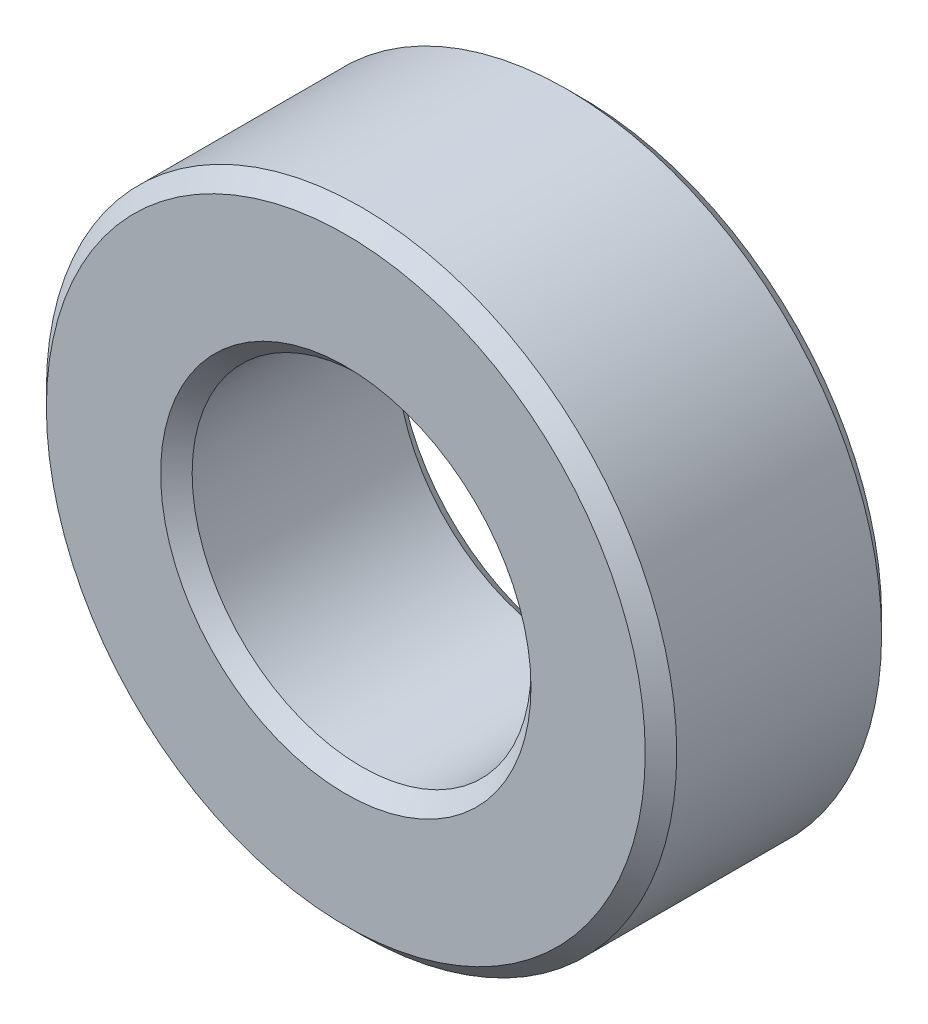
ISO-10303-21;
HEADER;
FILE_DESCRIPTION(('STEP AP214'),'2;1');
FILE_NAME('part.step','',(''),(''),'','','');
FILE_SCHEMA(('AUTOMOTIVE_DESIGN { 1 0 10303 214 1 1 1 1 }'));
ENDSEC;
DATA;
#1=APPLICATION_CONTEXT('core data for automotive mechanical design processes');
#2=APPLICATION_PROTOCOL_DEFINITION('international standard','automotive_design',2000,#1);
#3=PRODUCT_CONTEXT('',#1,'mechanical');
#4=PRODUCT('Part','Part','',(#3));
#5=PRODUCT_RELATED_PRODUCT_CATEGORY('part','',(#4));
#6=PRODUCT_DEFINITION_FORMATION('','',#4);
#7=PRODUCT_DEFINITION_CONTEXT('part definition',#1,'design');
#8=PRODUCT_DEFINITION('design','',#6,#7);
#9=PRODUCT_DEFINITION_SHAPE('','',#8);
#10=(LENGTH_UNIT() NAMED_UNIT(*) SI_UNIT(.MILLI.,.METRE.));
#11=(NAMED_UNIT(*) PLANE_ANGLE_UNIT() SI_UNIT($,.RADIAN.));
#12=(NAMED_UNIT(*) SI_UNIT($,.STERADIAN.) SOLID_ANGLE_UNIT());
#13=UNCERTAINTY_MEASURE_WITH_UNIT(LENGTH_MEASURE(1.E-05),#10,'distance_accuracy_value','');
#14=(GEOMETRIC_REPRESENTATION_CONTEXT(3) GLOBAL_UNCERTAINTY_ASSIGNED_CONTEXT((#13)) GLOBAL_UNIT_ASSIGNED_CONTEXT((#10,
#11,#12)) REPRESENTATION_CONTEXT('',''));
#15=CARTESIAN_POINT('',(0.,0.,0.));
#16=DIRECTION('',(0.,0.,1.));
#17=DIRECTION('',(1.,0.,0.));
#18=AXIS2_PLACEMENT_3D('',#15,#16,#17);
#19=CARTESIAN_POINT('',(0.,0.,1.5));
#20=DIRECTION('',(0.,0.,1.));
#21=DIRECTION('',(1.,0.,0.));
#22=AXIS2_PLACEMENT_3D('',#19,#20,#21);
#23=PLANE('',#22);
#24=CARTESIAN_POINT('',(0.,0.,1.5));
#25=DIRECTION('',(0.,0.,1.));
#26=DIRECTION('',(1.,0.,0.));
#27=AXIS2_PLACEMENT_3D('',#24,#25,#26);
#28=CIRCLE('',#27,2.35);
#29=CARTESIAN_POINT('',(2.35,0.,1.5));
#30=VERTEX_POINT('',#29);
#31=EDGE_CURVE('E10',#30,#30,#28,.F.);
#32=ORIENTED_EDGE('',*,*,#31,.T.);
#33=EDGE_LOOP('',(#32));
#34=FACE_BOUND('',#33,.T.);
#35=CARTESIAN_POINT('',(0.,0.,1.5));
#36=DIRECTION('',(0.,0.,1.));
#37=DIRECTION('',(1.,0.,0.));
#38=AXIS2_PLACEMENT_3D('',#35,#36,#37);
#39=CIRCLE('',#38,3.8);
#40=CARTESIAN_POINT('',(3.8,0.,1.5));
#41=VERTEX_POINT('',#40);
#42=EDGE_CURVE('E45',#41,#41,#39,.T.);
#43=ORIENTED_EDGE('',*,*,#42,.T.);
#44=EDGE_LOOP('',(#43));
#45=FACE_BOUND('',#44,.T.);
#46=ADVANCED_FACE('F37',(#34,#45),#23,.T.);
#47=CARTESIAN_POINT('',(0.,0.,-1.5));
#48=DIRECTION('',(0.,0.,1.));
#49=DIRECTION('',(1.,0.,0.));
#50=AXIS2_PLACEMENT_3D('',#47,#48,#49);
#51=PLANE('',#50);
#52=CARTESIAN_POINT('',(0.,0.,-1.5));
#53=DIRECTION('',(0.,0.,1.));
#54=DIRECTION('',(1.,0.,0.));
#55=AXIS2_PLACEMENT_3D('',#52,#53,#54);
#56=CIRCLE('',#55,3.8);
#57=CARTESIAN_POINT('',(3.8,0.,-1.5));
#58=VERTEX_POINT('',#57);
#59=EDGE_CURVE('E62',#58,#58,#56,.F.);
#60=ORIENTED_EDGE('',*,*,#59,.T.);
#61=EDGE_LOOP('',(#60));
#62=FACE_BOUND('',#61,.T.);
#63=CARTESIAN_POINT('',(0.,0.,-1.5));
#64=DIRECTION('',(0.,0.,1.));
#65=DIRECTION('',(1.,0.,0.));
#66=AXIS2_PLACEMENT_3D('',#63,#64,#65);
#67=CIRCLE('',#66,2.35);
#68=CARTESIAN_POINT('',(2.35,0.,-1.5));
#69=VERTEX_POINT('',#68);
#70=EDGE_CURVE('E66',#69,#69,#67,.T.);
#71=ORIENTED_EDGE('',*,*,#70,.T.);
#72=EDGE_LOOP('',(#71));
#73=FACE_BOUND('',#72,.T.);
#74=ADVANCED_FACE('F89',(#62,#73),#51,.F.);
#75=CARTESIAN_POINT('',(0.,0.,1.5));
#76=DIRECTION('',(0.,0.,-1.));
#77=DIRECTION('',(-1.,0.,0.));
#78=AXIS2_PLACEMENT_3D('',#75,#76,#77);
#79=CYLINDRICAL_SURFACE('',#78,4.);
#80=CARTESIAN_POINT('',(0.,0.,-1.3));
#81=DIRECTION('',(0.,0.,1.));
#82=DIRECTION('',(1.,0.,0.));
#83=AXIS2_PLACEMENT_3D('',#80,#81,#82);
#84=CIRCLE('',#83,4.);
#85=CARTESIAN_POINT('',(4.,0.,-1.3));
#86=VERTEX_POINT('',#85);
#87=EDGE_CURVE('E70',#86,#86,#84,.T.);
#88=ORIENTED_EDGE('',*,*,#87,.T.);
#89=EDGE_LOOP('',(#88));
#90=FACE_BOUND('',#89,.T.);
#91=CARTESIAN_POINT('',(0.,0.,1.3));
#92=DIRECTION('',(0.,0.,1.));
#93=DIRECTION('',(1.,0.,0.));
#94=AXIS2_PLACEMENT_3D('',#91,#92,#93);
#95=CIRCLE('',#94,4.);
#96=CARTESIAN_POINT('',(4.,0.,1.3));
#97=VERTEX_POINT('',#96);
#98=EDGE_CURVE('E74',#97,#97,#95,.F.);
#99=ORIENTED_EDGE('',*,*,#98,.T.);
#100=EDGE_LOOP('',(#99));
#101=FACE_BOUND('',#100,.T.);
#102=ADVANCED_FACE('F78',(#90,#101),#79,.T.);
#103=CARTESIAN_POINT('',(0.,0.,1.5));
#104=DIRECTION('',(0.,0.,-1.));
#105=DIRECTION('',(-1.,0.,0.));
#106=AXIS2_PLACEMENT_3D('',#103,#104,#105);
#107=CYLINDRICAL_SURFACE('',#106,2.15);
#108=CARTESIAN_POINT('',(0.,0.,-1.3));
#109=DIRECTION('',(0.,0.,1.));
#110=DIRECTION('',(1.,0.,0.));
#111=AXIS2_PLACEMENT_3D('',#108,#109,#110);
#112=CIRCLE('',#111,2.15);
#113=CARTESIAN_POINT('',(2.15,0.,-1.3));
#114=VERTEX_POINT('',#113);
#115=EDGE_CURVE('E51',#114,#114,#112,.F.);
#116=ORIENTED_EDGE('',*,*,#115,.T.);
#117=EDGE_LOOP('',(#116));
#118=FACE_BOUND('',#117,.T.);
#119=CARTESIAN_POINT('',(0.,0.,1.3));
#120=DIRECTION('',(0.,0.,1.));
#121=DIRECTION('',(1.,0.,0.));
#122=AXIS2_PLACEMENT_3D('',#119,#120,#121);
#123=CIRCLE('',#122,2.15);
#124=CARTESIAN_POINT('',(2.15,0.,1.3));
#125=VERTEX_POINT('',#124);
#126=EDGE_CURVE('E57',#125,#125,#123,.T.);
#127=ORIENTED_EDGE('',*,*,#126,.T.);
#128=EDGE_LOOP('',(#127));
#129=FACE_BOUND('',#128,.T.);
#130=ADVANCED_FACE('F97',(#118,#129),#107,.F.);
#131=CARTESIAN_POINT('',(0.,0.,-1.3));
#132=DIRECTION('',(0.,0.,1.));
#133=DIRECTION('',(1.,0.,0.));
#134=AXIS2_PLACEMENT_3D('',#131,#132,#133);
#135=CONICAL_SURFACE('',#134,4.,0.785398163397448);
#136=ORIENTED_EDGE('',*,*,#59,.F.);
#137=EDGE_LOOP('',(#136));
#138=FACE_BOUND('',#137,.T.);
#139=ORIENTED_EDGE('',*,*,#87,.F.);
#140=EDGE_LOOP('',(#139));
#141=FACE_BOUND('',#140,.T.);
#142=ADVANCED_FACE('F102',(#138,#141),#135,.T.);
#143=CARTESIAN_POINT('',(0.,0.,-1.5));
#144=DIRECTION('',(0.,0.,-1.));
#145=DIRECTION('',(-1.,0.,0.));
#146=AXIS2_PLACEMENT_3D('',#143,#144,#145);
#147=CONICAL_SURFACE('',#146,2.35,0.785398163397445);
#148=ORIENTED_EDGE('',*,*,#115,.F.);
#149=EDGE_LOOP('',(#148));
#150=FACE_BOUND('',#149,.T.);
#151=ORIENTED_EDGE('',*,*,#70,.F.);
#152=EDGE_LOOP('',(#151));
#153=FACE_BOUND('',#152,.T.);
#154=ADVANCED_FACE('F86',(#150,#153),#147,.F.);
#155=CARTESIAN_POINT('',(0.,0.,1.3));
#156=DIRECTION('',(0.,0.,1.));
#157=DIRECTION('',(1.,0.,0.));
#158=AXIS2_PLACEMENT_3D('',#155,#156,#157);
#159=CONICAL_SURFACE('',#158,2.15,0.785398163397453);
#160=ORIENTED_EDGE('',*,*,#31,.F.);
#161=EDGE_LOOP('',(#160));
#162=FACE_BOUND('',#161,.T.);
#163=ORIENTED_EDGE('',*,*,#126,.F.);
#164=EDGE_LOOP('',(#163));
#165=FACE_BOUND('',#164,.T.);
#166=ADVANCED_FACE('F82',(#162,#165),#159,.F.);
#167=CARTESIAN_POINT('',(0.,0.,1.5));
#168=DIRECTION('',(0.,0.,-1.));
#169=DIRECTION('',(-1.,0.,0.));
#170=AXIS2_PLACEMENT_3D('',#167,#168,#169);
#171=CONICAL_SURFACE('',#170,3.8,0.785398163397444);
#172=ORIENTED_EDGE('',*,*,#98,.F.);
#173=EDGE_LOOP('',(#172));
#174=FACE_BOUND('',#173,.T.);
#175=ORIENTED_EDGE('',*,*,#42,.F.);
#176=EDGE_LOOP('',(#175));
#177=FACE_BOUND('',#176,.T.);
#178=ADVANCED_FACE('F39',(#174,#177),#171,.T.);
#179=CLOSED_SHELL('',(#46,#74,#102,#130,#142,#154,#166,#178));
#180=MANIFOLD_SOLID_BREP('B2',#179);
#181=ADVANCED_BREP_SHAPE_REPRESENTATION('',(#18,#180),#14);
#182=SHAPE_DEFINITION_REPRESENTATION(#9,#181);
ENDSEC;
END-ISO-10303-21;
